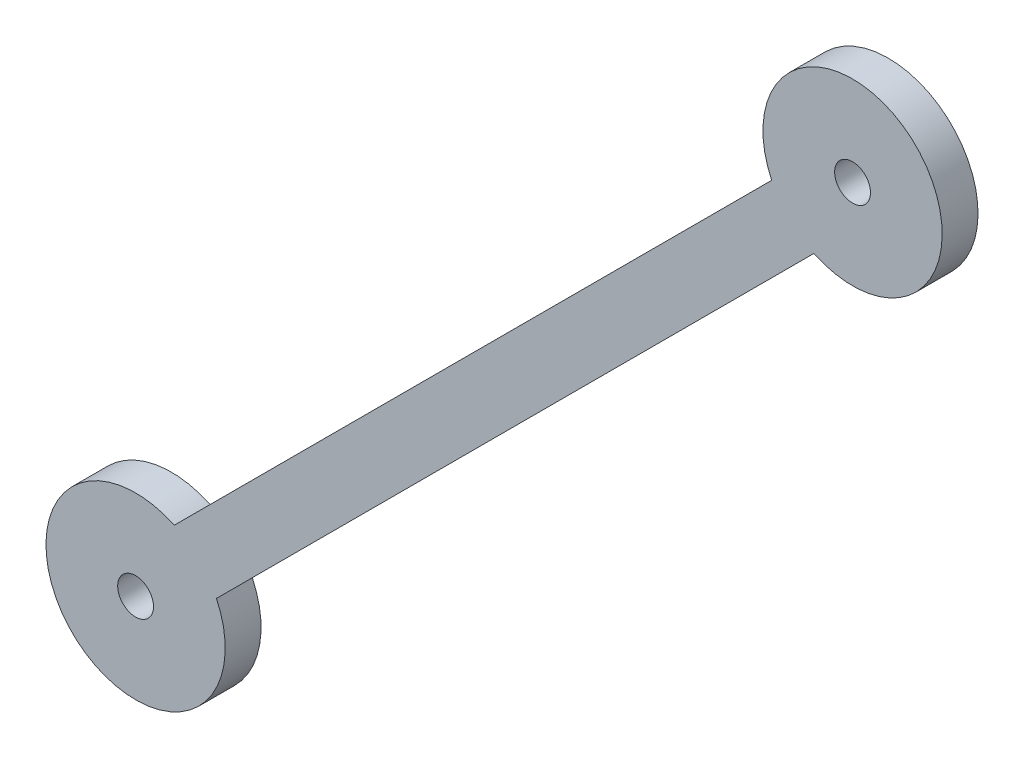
from build123d import *

# Parameters (mm, degrees)
ESQUISSE1_R      = 3
EXTRUSION1_DEPTH = 6


with BuildPart() as part:
    # Esquisse1 → Extrusion1 (new body)
    with BuildSketch(Plane.XY):
        with BuildLine():
            Line((6.464466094, 13.535533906), (106.464466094, 113.535533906))
            ThreePointArc((106.464466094, 113.535533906), (130.606601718, 130.606601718), (113.535533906, 106.464466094))
            Line((113.535533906, 106.464466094), (13.535533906, 6.464466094))
            ThreePointArc((13.535533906, 6.464466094), (-10.606601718, -10.606601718), (6.464466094, 13.535533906))
        make_face()
        Circle(ESQUISSE1_R, mode=Mode.SUBTRACT)
        with Locations((120, 120)):
            Circle(ESQUISSE1_R, mode=Mode.SUBTRACT)
    extrude(amount=EXTRUSION1_DEPTH)


solid = part.part
